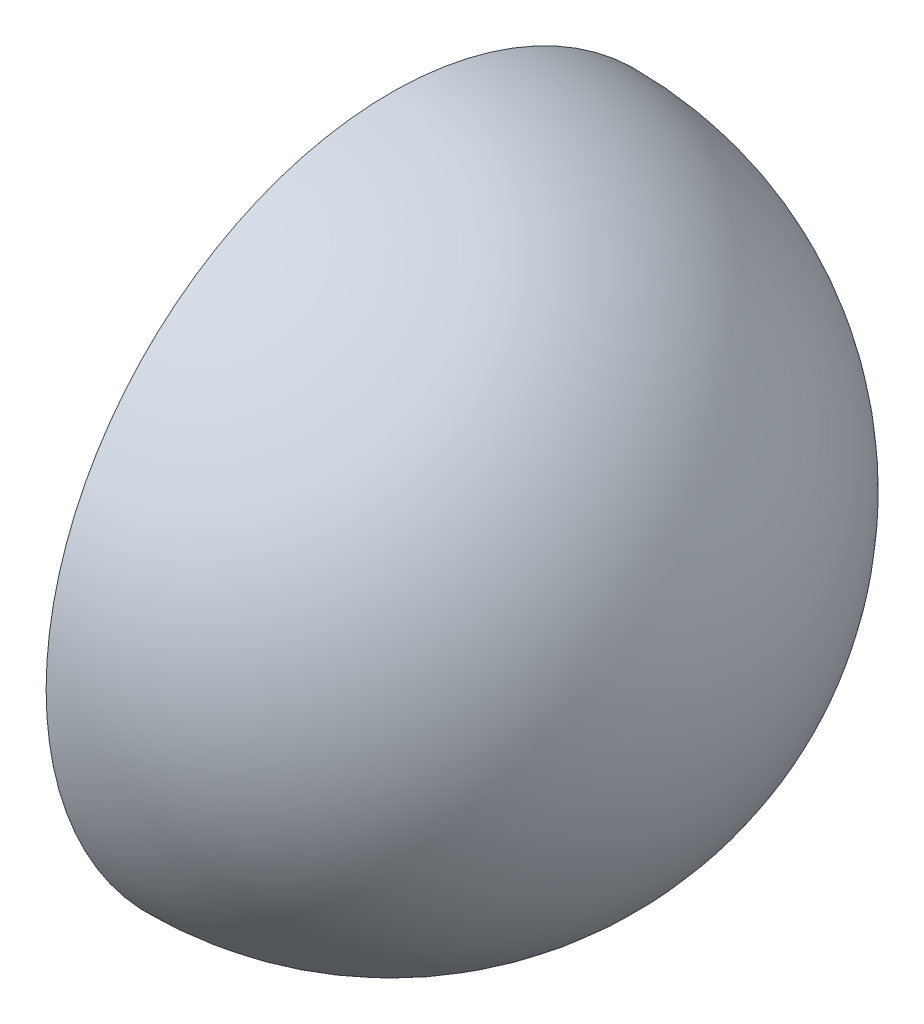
from build123d import *

# Parameters (mm, degrees)
REVOLVE1_ANGLE = 180


with BuildPart() as part:
    # Sketch1 → Revolve1 (revolve)
    with BuildSketch(Plane(origin=(0, 0, 0), x_dir=(0, 0, -1), z_dir=(1, 0, 0))):
        with BuildLine():
            Line((0, 76.2), (0, 101.6))
            ThreePointArc((0, 101.6), (-101.6, 0), (0, -101.6))
            Line((0, -101.6), (0, -76.2))
            ThreePointArc((0, -76.2), (-76.2, 0), (0, 76.2))
        make_face()
    revolve(axis=Axis((0, 76.2, 0), (0, 1, 0)), revolution_arc=REVOLVE1_ANGLE)


solid = part.part
